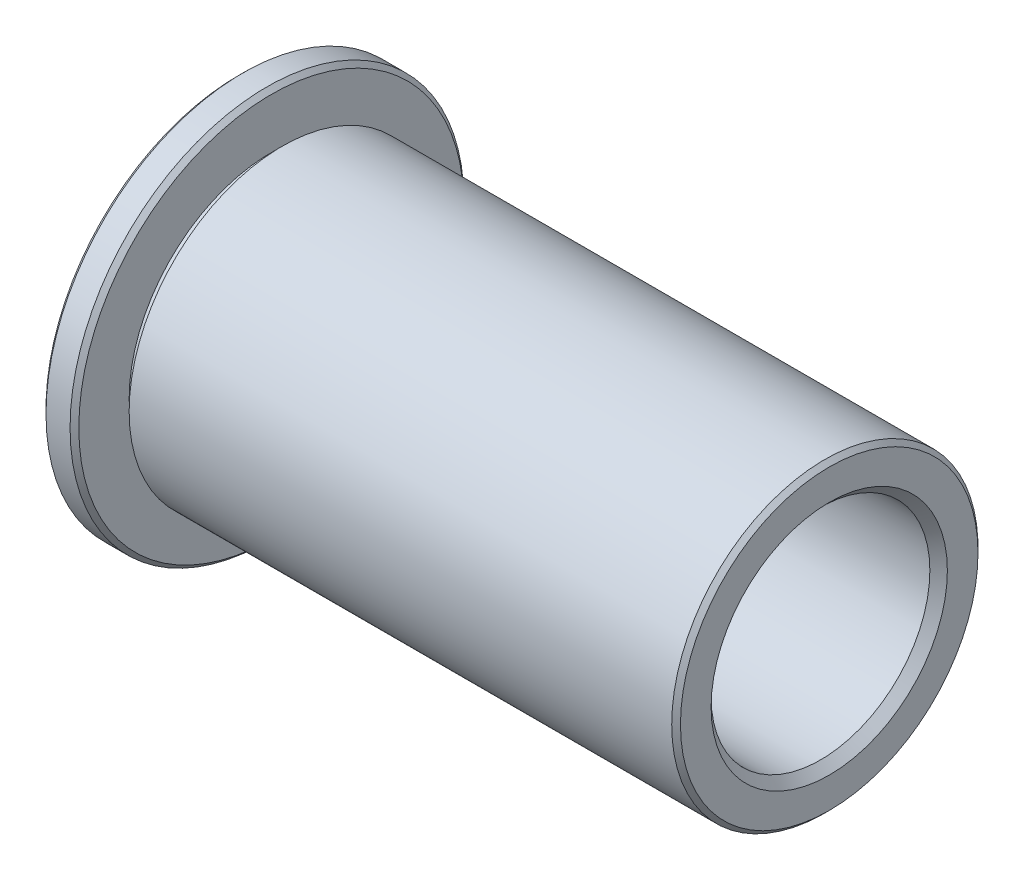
ISO-10303-21;
HEADER;
FILE_DESCRIPTION(('STEP AP214'),'2;1');
FILE_NAME('part.step','',(''),(''),'','','');
FILE_SCHEMA(('AUTOMOTIVE_DESIGN { 1 0 10303 214 1 1 1 1 }'));
ENDSEC;
DATA;
#1=APPLICATION_CONTEXT('core data for automotive mechanical design processes');
#2=APPLICATION_PROTOCOL_DEFINITION('international standard','automotive_design',2000,#1);
#3=PRODUCT_CONTEXT('',#1,'mechanical');
#4=PRODUCT('Part','Part','',(#3));
#5=PRODUCT_RELATED_PRODUCT_CATEGORY('part','',(#4));
#6=PRODUCT_DEFINITION_FORMATION('','',#4);
#7=PRODUCT_DEFINITION_CONTEXT('part definition',#1,'design');
#8=PRODUCT_DEFINITION('design','',#6,#7);
#9=PRODUCT_DEFINITION_SHAPE('','',#8);
#10=(LENGTH_UNIT() NAMED_UNIT(*) SI_UNIT(.MILLI.,.METRE.));
#11=(NAMED_UNIT(*) PLANE_ANGLE_UNIT() SI_UNIT($,.RADIAN.));
#12=(NAMED_UNIT(*) SI_UNIT($,.STERADIAN.) SOLID_ANGLE_UNIT());
#13=UNCERTAINTY_MEASURE_WITH_UNIT(LENGTH_MEASURE(1.E-05),#10,'distance_accuracy_value','');
#14=(GEOMETRIC_REPRESENTATION_CONTEXT(3) GLOBAL_UNCERTAINTY_ASSIGNED_CONTEXT((#13)) GLOBAL_UNIT_ASSIGNED_CONTEXT((#10,
#11,#12)) REPRESENTATION_CONTEXT('',''));
#15=CARTESIAN_POINT('',(0.,0.,0.));
#16=DIRECTION('',(0.,0.,1.));
#17=DIRECTION('',(1.,0.,0.));
#18=AXIS2_PLACEMENT_3D('',#15,#16,#17);
#19=CARTESIAN_POINT('',(0.,9.,0.));
#20=DIRECTION('',(1.,0.,0.));
#21=DIRECTION('',(0.,0.,-1.));
#22=AXIS2_PLACEMENT_3D('',#19,#20,#21);
#23=PLANE('',#22);
#24=CARTESIAN_POINT('',(0.,0.,0.));
#25=DIRECTION('',(1.,0.,0.));
#26=DIRECTION('',(0.,0.,-1.));
#27=AXIS2_PLACEMENT_3D('',#24,#25,#26);
#28=CIRCLE('',#27,8.8);
#29=CARTESIAN_POINT('',(0.,0.,-8.8));
#30=VERTEX_POINT('',#29);
#31=EDGE_CURVE('E66',#30,#30,#28,.F.);
#32=ORIENTED_EDGE('',*,*,#31,.T.);
#33=EDGE_LOOP('',(#32));
#34=FACE_BOUND('',#33,.T.);
#35=CARTESIAN_POINT('',(0.,0.,0.));
#36=DIRECTION('',(1.,0.,0.));
#37=DIRECTION('',(0.,0.,-1.));
#38=AXIS2_PLACEMENT_3D('',#35,#36,#37);
#39=CIRCLE('',#38,5.40000000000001);
#40=CARTESIAN_POINT('',(0.,0.,-5.40000000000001));
#41=VERTEX_POINT('',#40);
#42=EDGE_CURVE('E74',#41,#41,#39,.T.);
#43=ORIENTED_EDGE('',*,*,#42,.T.);
#44=EDGE_LOOP('',(#43));
#45=FACE_BOUND('',#44,.T.);
#46=ADVANCED_FACE('F36',(#34,#45),#23,.F.);
#47=CARTESIAN_POINT('',(0.,0.,0.));
#48=DIRECTION('',(-1.,0.,0.));
#49=DIRECTION('',(0.,0.,1.));
#50=AXIS2_PLACEMENT_3D('',#47,#48,#49);
#51=CYLINDRICAL_SURFACE('',#50,9.);
#52=CARTESIAN_POINT('',(0.200000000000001,0.,0.));
#53=DIRECTION('',(1.,0.,0.));
#54=DIRECTION('',(0.,0.,-1.));
#55=AXIS2_PLACEMENT_3D('',#52,#53,#54);
#56=CIRCLE('',#55,9.);
#57=CARTESIAN_POINT('',(0.200000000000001,0.,-9.));
#58=VERTEX_POINT('',#57);
#59=EDGE_CURVE('E56',#58,#58,#56,.T.);
#60=ORIENTED_EDGE('',*,*,#59,.T.);
#61=EDGE_LOOP('',(#60));
#62=FACE_BOUND('',#61,.T.);
#63=CARTESIAN_POINT('',(1.29999999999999,0.,0.));
#64=DIRECTION('',(-1.,0.,0.));
#65=DIRECTION('',(0.,0.,1.));
#66=AXIS2_PLACEMENT_3D('',#63,#64,#65);
#67=CIRCLE('',#66,9.);
#68=CARTESIAN_POINT('',(1.29999999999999,0.,9.));
#69=VERTEX_POINT('',#68);
#70=EDGE_CURVE('E62',#69,#69,#67,.T.);
#71=ORIENTED_EDGE('',*,*,#70,.T.);
#72=EDGE_LOOP('',(#71));
#73=FACE_BOUND('',#72,.T.);
#74=ADVANCED_FACE('F116',(#62,#73),#51,.T.);
#75=CARTESIAN_POINT('',(1.5,9.,0.));
#76=DIRECTION('',(-1.,0.,0.));
#77=DIRECTION('',(0.,0.,1.));
#78=AXIS2_PLACEMENT_3D('',#75,#76,#77);
#79=PLANE('',#78);
#80=CARTESIAN_POINT('',(1.5,0.,0.));
#81=DIRECTION('',(-1.,0.,0.));
#82=DIRECTION('',(0.,0.,1.));
#83=AXIS2_PLACEMENT_3D('',#80,#81,#82);
#84=CIRCLE('',#83,8.79999999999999);
#85=CARTESIAN_POINT('',(1.5,0.,8.79999999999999));
#86=VERTEX_POINT('',#85);
#87=EDGE_CURVE('E50',#86,#86,#84,.F.);
#88=ORIENTED_EDGE('',*,*,#87,.T.);
#89=EDGE_LOOP('',(#88));
#90=FACE_BOUND('',#89,.T.);
#91=CARTESIAN_POINT('',(1.5,0.,0.));
#92=DIRECTION('',(-1.,0.,0.));
#93=DIRECTION('',(0.,0.,1.));
#94=AXIS2_PLACEMENT_3D('',#91,#92,#93);
#95=CIRCLE('',#94,6.5);
#96=CARTESIAN_POINT('',(1.5,0.,6.5));
#97=VERTEX_POINT('',#96);
#98=EDGE_CURVE('E86',#97,#97,#95,.T.);
#99=ORIENTED_EDGE('',*,*,#98,.T.);
#100=EDGE_LOOP('',(#99));
#101=FACE_BOUND('',#100,.T.);
#102=ADVANCED_FACE('F122',(#90,#101),#79,.F.);
#103=CARTESIAN_POINT('',(0.,0.,0.));
#104=DIRECTION('',(-1.,0.,0.));
#105=DIRECTION('',(0.,0.,1.));
#106=AXIS2_PLACEMENT_3D('',#103,#104,#105);
#107=CYLINDRICAL_SURFACE('',#106,6.5);
#108=ORIENTED_EDGE('',*,*,#98,.F.);
#109=EDGE_LOOP('',(#108));
#110=FACE_BOUND('',#109,.T.);
#111=CARTESIAN_POINT('',(2.,0.,0.));
#112=DIRECTION('',(-1.,0.,0.));
#113=DIRECTION('',(0.,0.,1.));
#114=AXIS2_PLACEMENT_3D('',#111,#112,#113);
#115=CIRCLE('',#114,6.5);
#116=CARTESIAN_POINT('',(2.,0.,6.5));
#117=VERTEX_POINT('',#116);
#118=EDGE_CURVE('E90',#117,#117,#115,.T.);
#119=ORIENTED_EDGE('',*,*,#118,.T.);
#120=EDGE_LOOP('',(#119));
#121=FACE_BOUND('',#120,.T.);
#122=ADVANCED_FACE('F112',(#110,#121),#107,.T.);
#123=CARTESIAN_POINT('',(2.,6.5,0.));
#124=DIRECTION('',(1.,0.,0.));
#125=DIRECTION('',(0.,0.,-1.));
#126=AXIS2_PLACEMENT_3D('',#123,#124,#125);
#127=PLANE('',#126);
#128=ORIENTED_EDGE('',*,*,#118,.F.);
#129=EDGE_LOOP('',(#128));
#130=FACE_BOUND('',#129,.T.);
#131=CARTESIAN_POINT('',(2.,0.,0.));
#132=DIRECTION('',(-1.,0.,0.));
#133=DIRECTION('',(0.,0.,1.));
#134=AXIS2_PLACEMENT_3D('',#131,#132,#133);
#135=CIRCLE('',#134,7.);
#136=CARTESIAN_POINT('',(2.,0.,7.));
#137=VERTEX_POINT('',#136);
#138=EDGE_CURVE('E94',#137,#137,#135,.T.);
#139=ORIENTED_EDGE('',*,*,#138,.T.);
#140=EDGE_LOOP('',(#139));
#141=FACE_BOUND('',#140,.T.);
#142=ADVANCED_FACE('F100',(#130,#141),#127,.F.);
#143=CARTESIAN_POINT('',(0.,0.,0.));
#144=DIRECTION('',(-1.,0.,0.));
#145=DIRECTION('',(0.,0.,1.));
#146=AXIS2_PLACEMENT_3D('',#143,#144,#145);
#147=CYLINDRICAL_SURFACE('',#146,7.);
#148=CARTESIAN_POINT('',(26.8,0.,0.));
#149=DIRECTION('',(-1.,0.,0.));
#150=DIRECTION('',(0.,0.,1.));
#151=AXIS2_PLACEMENT_3D('',#148,#149,#150);
#152=CIRCLE('',#151,7.);
#153=CARTESIAN_POINT('',(26.8,0.,7.));
#154=VERTEX_POINT('',#153);
#155=EDGE_CURVE('E44',#154,#154,#152,.T.);
#156=ORIENTED_EDGE('',*,*,#155,.T.);
#157=EDGE_LOOP('',(#156));
#158=FACE_BOUND('',#157,.T.);
#159=ORIENTED_EDGE('',*,*,#138,.F.);
#160=EDGE_LOOP('',(#159));
#161=FACE_BOUND('',#160,.T.);
#162=ADVANCED_FACE('F102',(#158,#161),#147,.T.);
#163=CARTESIAN_POINT('',(27.,7.,0.));
#164=DIRECTION('',(-1.,0.,0.));
#165=DIRECTION('',(0.,0.,1.));
#166=AXIS2_PLACEMENT_3D('',#163,#164,#165);
#167=PLANE('',#166);
#168=CARTESIAN_POINT('',(27.,0.,0.));
#169=DIRECTION('',(-1.,0.,0.));
#170=DIRECTION('',(0.,0.,1.));
#171=AXIS2_PLACEMENT_3D('',#168,#169,#170);
#172=CIRCLE('',#171,6.8);
#173=CARTESIAN_POINT('',(27.,0.,6.8));
#174=VERTEX_POINT('',#173);
#175=EDGE_CURVE('E10',#174,#174,#172,.F.);
#176=ORIENTED_EDGE('',*,*,#175,.T.);
#177=EDGE_LOOP('',(#176));
#178=FACE_BOUND('',#177,.T.);
#179=CARTESIAN_POINT('',(27.,0.,0.));
#180=DIRECTION('',(-1.,0.,0.));
#181=DIRECTION('',(0.,0.,1.));
#182=AXIS2_PLACEMENT_3D('',#179,#180,#181);
#183=CIRCLE('',#182,5.4);
#184=CARTESIAN_POINT('',(27.,0.,5.4));
#185=VERTEX_POINT('',#184);
#186=EDGE_CURVE('E70',#185,#185,#183,.T.);
#187=ORIENTED_EDGE('',*,*,#186,.T.);
#188=EDGE_LOOP('',(#187));
#189=FACE_BOUND('',#188,.T.);
#190=ADVANCED_FACE('F104',(#178,#189),#167,.F.);
#191=CARTESIAN_POINT('',(0.,0.,0.));
#192=DIRECTION('',(-1.,0.,0.));
#193=DIRECTION('',(0.,0.,1.));
#194=AXIS2_PLACEMENT_3D('',#191,#192,#193);
#195=CYLINDRICAL_SURFACE('',#194,5.);
#196=CARTESIAN_POINT('',(0.400000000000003,0.,0.));
#197=DIRECTION('',(1.,0.,0.));
#198=DIRECTION('',(0.,0.,-1.));
#199=AXIS2_PLACEMENT_3D('',#196,#197,#198);
#200=CIRCLE('',#199,5.);
#201=CARTESIAN_POINT('',(0.400000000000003,0.,-5.));
#202=VERTEX_POINT('',#201);
#203=EDGE_CURVE('E78',#202,#202,#200,.F.);
#204=ORIENTED_EDGE('',*,*,#203,.T.);
#205=EDGE_LOOP('',(#204));
#206=FACE_BOUND('',#205,.T.);
#207=CARTESIAN_POINT('',(26.6,0.,0.));
#208=DIRECTION('',(-1.,0.,0.));
#209=DIRECTION('',(0.,0.,1.));
#210=AXIS2_PLACEMENT_3D('',#207,#208,#209);
#211=CIRCLE('',#210,5.);
#212=CARTESIAN_POINT('',(26.6,0.,5.));
#213=VERTEX_POINT('',#212);
#214=EDGE_CURVE('E82',#213,#213,#211,.F.);
#215=ORIENTED_EDGE('',*,*,#214,.T.);
#216=EDGE_LOOP('',(#215));
#217=FACE_BOUND('',#216,.T.);
#218=ADVANCED_FACE('F110',(#206,#217),#195,.F.);
#219=CARTESIAN_POINT('',(0.400000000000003,0.,0.));
#220=DIRECTION('',(-1.,0.,0.));
#221=DIRECTION('',(0.,0.,1.));
#222=AXIS2_PLACEMENT_3D('',#219,#220,#221);
#223=CONICAL_SURFACE('',#222,5.,0.785398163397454);
#224=ORIENTED_EDGE('',*,*,#42,.F.);
#225=EDGE_LOOP('',(#224));
#226=FACE_BOUND('',#225,.T.);
#227=ORIENTED_EDGE('',*,*,#203,.F.);
#228=EDGE_LOOP('',(#227));
#229=FACE_BOUND('',#228,.T.);
#230=ADVANCED_FACE('F128',(#226,#229),#223,.F.);
#231=CARTESIAN_POINT('',(27.,0.,0.));
#232=DIRECTION('',(1.,0.,0.));
#233=DIRECTION('',(0.,0.,-1.));
#234=AXIS2_PLACEMENT_3D('',#231,#232,#233);
#235=CONICAL_SURFACE('',#234,5.4,0.785398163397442);
#236=ORIENTED_EDGE('',*,*,#214,.F.);
#237=EDGE_LOOP('',(#236));
#238=FACE_BOUND('',#237,.T.);
#239=ORIENTED_EDGE('',*,*,#186,.F.);
#240=EDGE_LOOP('',(#239));
#241=FACE_BOUND('',#240,.T.);
#242=ADVANCED_FACE('F131',(#238,#241),#235,.F.);
#243=CARTESIAN_POINT('',(0.,0.,0.));
#244=DIRECTION('',(1.,0.,0.));
#245=DIRECTION('',(0.,0.,-1.));
#246=AXIS2_PLACEMENT_3D('',#243,#244,#245);
#247=CONICAL_SURFACE('',#246,8.8,0.785398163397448);
#248=ORIENTED_EDGE('',*,*,#59,.F.);
#249=EDGE_LOOP('',(#248));
#250=FACE_BOUND('',#249,.T.);
#251=ORIENTED_EDGE('',*,*,#31,.F.);
#252=EDGE_LOOP('',(#251));
#253=FACE_BOUND('',#252,.T.);
#254=ADVANCED_FACE('F135',(#250,#253),#247,.T.);
#255=CARTESIAN_POINT('',(1.29999999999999,0.,0.));
#256=DIRECTION('',(-1.,0.,0.));
#257=DIRECTION('',(0.,0.,1.));
#258=AXIS2_PLACEMENT_3D('',#255,#256,#257);
#259=CONICAL_SURFACE('',#258,9.,0.785398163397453);
#260=ORIENTED_EDGE('',*,*,#87,.F.);
#261=EDGE_LOOP('',(#260));
#262=FACE_BOUND('',#261,.T.);
#263=ORIENTED_EDGE('',*,*,#70,.F.);
#264=EDGE_LOOP('',(#263));
#265=FACE_BOUND('',#264,.T.);
#266=ADVANCED_FACE('F138',(#262,#265),#259,.T.);
#267=CARTESIAN_POINT('',(26.8,0.,0.));
#268=DIRECTION('',(-1.,0.,0.));
#269=DIRECTION('',(0.,0.,1.));
#270=AXIS2_PLACEMENT_3D('',#267,#268,#269);
#271=CONICAL_SURFACE('',#270,7.,0.78539816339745);
#272=ORIENTED_EDGE('',*,*,#175,.F.);
#273=EDGE_LOOP('',(#272));
#274=FACE_BOUND('',#273,.T.);
#275=ORIENTED_EDGE('',*,*,#155,.F.);
#276=EDGE_LOOP('',(#275));
#277=FACE_BOUND('',#276,.T.);
#278=ADVANCED_FACE('F38',(#274,#277),#271,.T.);
#279=CLOSED_SHELL('',(#46,#74,#102,#122,#142,#162,#190,#218,#230,#242,#254,#266,#278));
#280=MANIFOLD_SOLID_BREP('B2',#279);
#281=ADVANCED_BREP_SHAPE_REPRESENTATION('',(#18,#280),#14);
#282=SHAPE_DEFINITION_REPRESENTATION(#9,#281);
ENDSEC;
END-ISO-10303-21;
